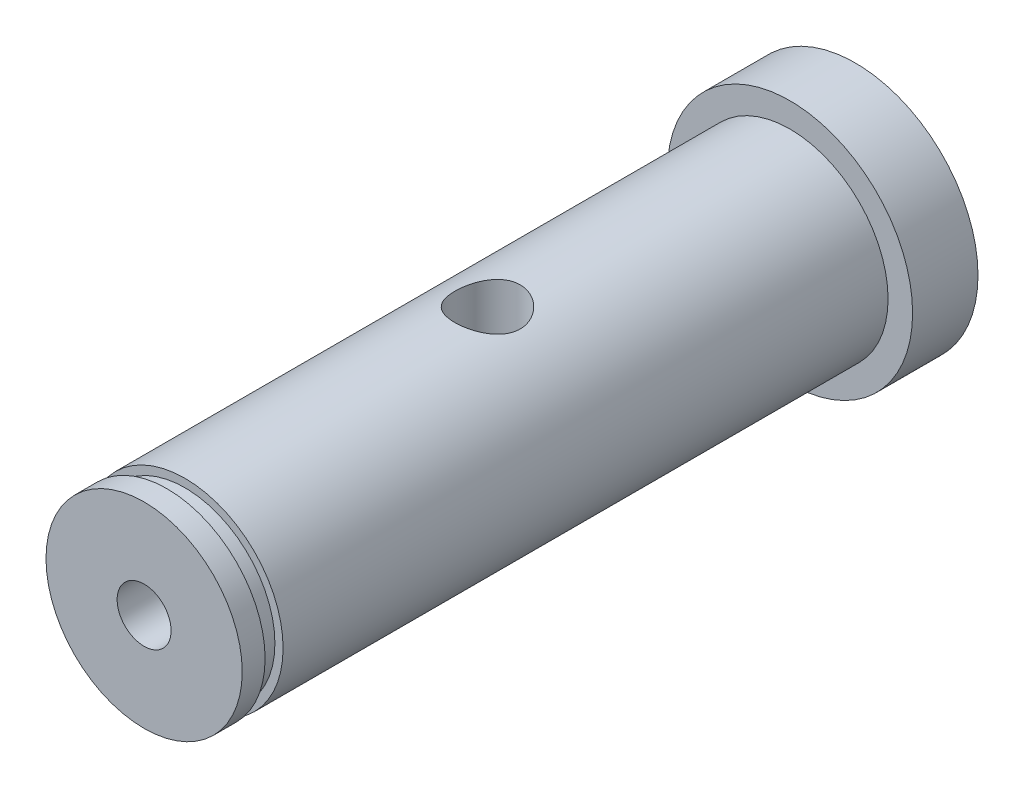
ISO-10303-21;
HEADER;
FILE_DESCRIPTION(('STEP AP214'),'2;1');
FILE_NAME('part.step','',(''),(''),'','','');
FILE_SCHEMA(('AUTOMOTIVE_DESIGN { 1 0 10303 214 1 1 1 1 }'));
ENDSEC;
DATA;
#1=APPLICATION_CONTEXT('core data for automotive mechanical design processes');
#2=APPLICATION_PROTOCOL_DEFINITION('international standard','automotive_design',2000,#1);
#3=PRODUCT_CONTEXT('',#1,'mechanical');
#4=PRODUCT('Part','Part','',(#3));
#5=PRODUCT_RELATED_PRODUCT_CATEGORY('part','',(#4));
#6=PRODUCT_DEFINITION_FORMATION('','',#4);
#7=PRODUCT_DEFINITION_CONTEXT('part definition',#1,'design');
#8=PRODUCT_DEFINITION('design','',#6,#7);
#9=PRODUCT_DEFINITION_SHAPE('','',#8);
#10=(LENGTH_UNIT() NAMED_UNIT(*) SI_UNIT(.MILLI.,.METRE.));
#11=(NAMED_UNIT(*) PLANE_ANGLE_UNIT() SI_UNIT($,.RADIAN.));
#12=(NAMED_UNIT(*) SI_UNIT($,.STERADIAN.) SOLID_ANGLE_UNIT());
#13=UNCERTAINTY_MEASURE_WITH_UNIT(LENGTH_MEASURE(1.E-05),#10,'distance_accuracy_value','');
#14=(GEOMETRIC_REPRESENTATION_CONTEXT(3) GLOBAL_UNCERTAINTY_ASSIGNED_CONTEXT((#13)) GLOBAL_UNIT_ASSIGNED_CONTEXT((#10,
#11,#12)) REPRESENTATION_CONTEXT('',''));
#15=CARTESIAN_POINT('',(0.,0.,0.));
#16=DIRECTION('',(0.,0.,1.));
#17=DIRECTION('',(1.,0.,0.));
#18=AXIS2_PLACEMENT_3D('',#15,#16,#17);
#19=CARTESIAN_POINT('',(0.,0.,21.));
#20=DIRECTION('',(0.,0.,-1.));
#21=DIRECTION('',(-1.,0.,0.));
#22=AXIS2_PLACEMENT_3D('',#19,#20,#21);
#23=CYLINDRICAL_SURFACE('',#22,6.);
#24=CARTESIAN_POINT('',(0.,0.,19.6));
#25=DIRECTION('',(0.,0.,1.));
#26=DIRECTION('',(1.,0.,0.));
#27=AXIS2_PLACEMENT_3D('',#24,#25,#26);
#28=CIRCLE('',#27,6.);
#29=CARTESIAN_POINT('',(-6.,0.,19.6));
#30=VERTEX_POINT('',#29);
#31=EDGE_CURVE('E51',#30,#30,#28,.T.);
#32=CARTESIAN_POINT('',(0.,0.,21.));
#33=DIRECTION('',(0.,0.,1.));
#34=DIRECTION('',(1.,0.,0.));
#35=AXIS2_PLACEMENT_3D('',#32,#33,#34);
#36=CIRCLE('',#35,6.);
#37=CARTESIAN_POINT('',(-6.,0.,21.));
#38=VERTEX_POINT('',#37);
#39=EDGE_CURVE('E11',#38,#38,#36,.T.);
#40=CARTESIAN_POINT('',(-6.,0.,19.6));
#41=CARTESIAN_POINT('',(-6.,0.,19.6145833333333));
#42=CARTESIAN_POINT('',(-6.,0.,19.6291666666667));
#43=CARTESIAN_POINT('',(-6.,0.,19.6583333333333));
#44=CARTESIAN_POINT('',(-6.,0.,19.6729166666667));
#45=CARTESIAN_POINT('',(-6.,0.,19.7020833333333));
#46=CARTESIAN_POINT('',(-6.,0.,19.7166666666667));
#47=CARTESIAN_POINT('',(-6.,0.,19.7458333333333));
#48=CARTESIAN_POINT('',(-6.,0.,19.7604166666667));
#49=CARTESIAN_POINT('',(-6.,0.,19.7895833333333));
#50=CARTESIAN_POINT('',(-6.,0.,19.8041666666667));
#51=CARTESIAN_POINT('',(-6.,0.,19.8333333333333));
#52=CARTESIAN_POINT('',(-6.,0.,19.8479166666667));
#53=CARTESIAN_POINT('',(-6.,0.,19.8770833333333));
#54=CARTESIAN_POINT('',(-6.,0.,19.8916666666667));
#55=CARTESIAN_POINT('',(-6.,0.,19.9208333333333));
#56=CARTESIAN_POINT('',(-6.,0.,19.9354166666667));
#57=CARTESIAN_POINT('',(-6.,0.,19.9645833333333));
#58=CARTESIAN_POINT('',(-6.,0.,19.9791666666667));
#59=CARTESIAN_POINT('',(-6.,0.,20.0083333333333));
#60=CARTESIAN_POINT('',(-6.,0.,20.0229166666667));
#61=CARTESIAN_POINT('',(-6.,0.,20.0520833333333));
#62=CARTESIAN_POINT('',(-6.,0.,20.0666666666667));
#63=CARTESIAN_POINT('',(-6.,0.,20.0958333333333));
#64=CARTESIAN_POINT('',(-6.,0.,20.1104166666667));
#65=CARTESIAN_POINT('',(-6.,0.,20.1395833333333));
#66=CARTESIAN_POINT('',(-6.,0.,20.1541666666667));
#67=CARTESIAN_POINT('',(-6.,0.,20.1833333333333));
#68=CARTESIAN_POINT('',(-6.,0.,20.1979166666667));
#69=CARTESIAN_POINT('',(-6.,0.,20.2270833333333));
#70=CARTESIAN_POINT('',(-6.,0.,20.2416666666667));
#71=CARTESIAN_POINT('',(-6.,0.,20.2708333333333));
#72=CARTESIAN_POINT('',(-6.,0.,20.2854166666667));
#73=CARTESIAN_POINT('',(-6.,0.,20.3145833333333));
#74=CARTESIAN_POINT('',(-6.,0.,20.3291666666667));
#75=CARTESIAN_POINT('',(-6.,0.,20.3583333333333));
#76=CARTESIAN_POINT('',(-6.,0.,20.3729166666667));
#77=CARTESIAN_POINT('',(-6.,0.,20.4020833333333));
#78=CARTESIAN_POINT('',(-6.,0.,20.4166666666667));
#79=CARTESIAN_POINT('',(-6.,0.,20.4458333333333));
#80=CARTESIAN_POINT('',(-6.,0.,20.4604166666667));
#81=CARTESIAN_POINT('',(-6.,0.,20.4895833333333));
#82=CARTESIAN_POINT('',(-6.,0.,20.5041666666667));
#83=CARTESIAN_POINT('',(-6.,0.,20.5333333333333));
#84=CARTESIAN_POINT('',(-6.,0.,20.5479166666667));
#85=CARTESIAN_POINT('',(-6.,0.,20.5770833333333));
#86=CARTESIAN_POINT('',(-6.,0.,20.5916666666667));
#87=CARTESIAN_POINT('',(-6.,0.,20.6208333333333));
#88=CARTESIAN_POINT('',(-6.,0.,20.6354166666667));
#89=CARTESIAN_POINT('',(-6.,0.,20.6645833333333));
#90=CARTESIAN_POINT('',(-6.,0.,20.6791666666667));
#91=CARTESIAN_POINT('',(-6.,0.,20.7083333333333));
#92=CARTESIAN_POINT('',(-6.,0.,20.7229166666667));
#93=CARTESIAN_POINT('',(-6.,0.,20.7520833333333));
#94=CARTESIAN_POINT('',(-6.,0.,20.7666666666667));
#95=CARTESIAN_POINT('',(-6.,0.,20.7958333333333));
#96=CARTESIAN_POINT('',(-6.,0.,20.8104166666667));
#97=CARTESIAN_POINT('',(-6.,0.,20.8395833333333));
#98=CARTESIAN_POINT('',(-6.,0.,20.8541666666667));
#99=CARTESIAN_POINT('',(-6.,0.,20.8833333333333));
#100=CARTESIAN_POINT('',(-6.,0.,20.8979166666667));
#101=CARTESIAN_POINT('',(-6.,0.,20.9270833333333));
#102=CARTESIAN_POINT('',(-6.,0.,20.9416666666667));
#103=CARTESIAN_POINT('',(-6.,0.,20.9708333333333));
#104=CARTESIAN_POINT('',(-6.,0.,20.9854166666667));
#105=CARTESIAN_POINT('',(-6.,0.,21.));
#106=B_SPLINE_CURVE_WITH_KNOTS('',3,(#40,#41,#42,#43,#44,#45,#46,#47,#48,#49,#50,#51,#52,#53,
#54,#55,#56,#57,#58,#59,#60,#61,#62,#63,#64,#65,#66,#67,#68,#69,#70,#71,#72,#73,#74,#75,#76,#77,
#78,#79,#80,#81,#82,#83,#84,#85,#86,#87,#88,#89,#90,#91,#92,#93,#94,#95,#96,#97,#98,#99,#100,
#101,#102,#103,#104,#105),.UNSPECIFIED.,.F.,.F.,(4,2,2,2,2,2,2,2,2,2,2,2,2,2,2,2,2,2,2,2,2,2,2,
2,2,2,2,2,2,2,2,2,4),(0.,0.0437500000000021,0.0875000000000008,0.131250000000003,
0.175000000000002,0.21875,0.262500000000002,0.306250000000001,0.350000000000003,
0.393750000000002,0.437500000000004,0.481250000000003,0.525000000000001,0.568750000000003,
0.612500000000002,0.656250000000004,0.700000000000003,0.743750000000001,0.787500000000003,
0.831250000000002,0.875000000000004,0.918750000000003,0.962500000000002,1.00625,1.05,1.09375,
1.1375,1.18125,1.225,1.26875,1.3125,1.35625,1.40000000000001),.UNSPECIFIED.);
#107=EDGE_CURVE('BSEAM40',#30,#38,#106,.T.);
#108=ORIENTED_EDGE('',*,*,#31,.T.);
#109=ORIENTED_EDGE('',*,*,#39,.F.);
#110=ORIENTED_EDGE('',*,*,#107,.T.);
#111=ORIENTED_EDGE('',*,*,#107,.F.);
#112=EDGE_LOOP('',(#108,#110,#109,#111));
#113=FACE_BOUND('',#112,.T.);
#114=ADVANCED_FACE('F40',(#113),#23,.T.);
#115=CARTESIAN_POINT('',(0.,0.,21.));
#116=DIRECTION('',(0.,0.,1.));
#117=DIRECTION('',(1.,0.,0.));
#118=AXIS2_PLACEMENT_3D('',#115,#116,#117);
#119=PLANE('',#118);
#120=CARTESIAN_POINT('',(0.,0.,21.));
#121=DIRECTION('',(0.,0.,1.));
#122=DIRECTION('',(1.,0.,0.));
#123=AXIS2_PLACEMENT_3D('',#120,#121,#122);
#124=CIRCLE('',#123,1.64999999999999);
#125=CARTESIAN_POINT('',(1.64999999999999,0.,21.));
#126=VERTEX_POINT('',#125);
#127=EDGE_CURVE('E66',#126,#126,#124,.T.);
#128=ORIENTED_EDGE('',*,*,#127,.F.);
#129=EDGE_LOOP('',(#128));
#130=FACE_BOUND('',#129,.T.);
#131=ORIENTED_EDGE('',*,*,#39,.T.);
#132=EDGE_LOOP('',(#131));
#133=FACE_BOUND('',#132,.T.);
#134=ADVANCED_FACE('F117',(#130,#133),#119,.T.);
#135=CARTESIAN_POINT('',(0.,0.,19.6));
#136=DIRECTION('',(0.,0.,1.));
#137=DIRECTION('',(1.,0.,0.));
#138=AXIS2_PLACEMENT_3D('',#135,#136,#137);
#139=PLANE('',#138);
#140=CARTESIAN_POINT('',(0.,0.,19.6));
#141=DIRECTION('',(0.,0.,1.));
#142=DIRECTION('',(1.,0.,0.));
#143=AXIS2_PLACEMENT_3D('',#140,#141,#142);
#144=CIRCLE('',#143,5.5);
#145=CARTESIAN_POINT('',(5.5,0.,19.6));
#146=VERTEX_POINT('',#145);
#147=EDGE_CURVE('E69',#146,#146,#144,.T.);
#148=ORIENTED_EDGE('',*,*,#147,.T.);
#149=EDGE_LOOP('',(#148));
#150=FACE_BOUND('',#149,.T.);
#151=ORIENTED_EDGE('',*,*,#31,.F.);
#152=EDGE_LOOP('',(#151));
#153=FACE_BOUND('',#152,.T.);
#154=ADVANCED_FACE('F114',(#150,#153),#139,.F.);
#155=CARTESIAN_POINT('',(0.,0.,18.5));
#156=DIRECTION('',(0.,0.,1.));
#157=DIRECTION('',(1.,0.,0.));
#158=AXIS2_PLACEMENT_3D('',#155,#156,#157);
#159=PLANE('',#158);
#160=CARTESIAN_POINT('',(0.,0.,18.5));
#161=DIRECTION('',(0.,0.,1.));
#162=DIRECTION('',(1.,0.,0.));
#163=AXIS2_PLACEMENT_3D('',#160,#161,#162);
#164=CIRCLE('',#163,5.5);
#165=CARTESIAN_POINT('',(5.5,0.,18.5));
#166=VERTEX_POINT('',#165);
#167=EDGE_CURVE('E65',#166,#166,#164,.T.);
#168=ORIENTED_EDGE('',*,*,#167,.F.);
#169=EDGE_LOOP('',(#168));
#170=FACE_BOUND('',#169,.T.);
#171=CARTESIAN_POINT('',(0.,0.,18.5));
#172=DIRECTION('',(0.,0.,1.));
#173=DIRECTION('',(1.,0.,0.));
#174=AXIS2_PLACEMENT_3D('',#171,#172,#173);
#175=CIRCLE('',#174,6.);
#176=CARTESIAN_POINT('',(6.,0.,18.5));
#177=VERTEX_POINT('',#176);
#178=EDGE_CURVE('E77',#177,#177,#175,.T.);
#179=ORIENTED_EDGE('',*,*,#178,.T.);
#180=EDGE_LOOP('',(#179));
#181=FACE_BOUND('',#180,.T.);
#182=ADVANCED_FACE('F112',(#170,#181),#159,.T.);
#183=CARTESIAN_POINT('',(0.,0.,19.6));
#184=DIRECTION('',(0.,0.,-1.));
#185=DIRECTION('',(-1.,0.,0.));
#186=AXIS2_PLACEMENT_3D('',#183,#184,#185);
#187=CYLINDRICAL_SURFACE('',#186,5.5);
#188=ORIENTED_EDGE('',*,*,#147,.F.);
#189=EDGE_LOOP('',(#188));
#190=FACE_BOUND('',#189,.T.);
#191=ORIENTED_EDGE('',*,*,#167,.T.);
#192=EDGE_LOOP('',(#191));
#193=FACE_BOUND('',#192,.T.);
#194=ADVANCED_FACE('F109',(#190,#193),#187,.T.);
#195=CARTESIAN_POINT('',(0.,-6.,2.));
#196=CARTESIAN_POINT('',(0.109126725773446,-6.00000030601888,2.00000050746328));
#197=CARTESIAN_POINT('',(0.2182503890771,-5.9969953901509,1.99103946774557));
#198=CARTESIAN_POINT('',(0.433283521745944,-5.98530420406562,1.95554178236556));
#199=CARTESIAN_POINT('',(0.539192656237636,-5.97661734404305,1.92900331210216));
#200=CARTESIAN_POINT('',(0.744665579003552,-5.95450615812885,1.8593615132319));
#201=CARTESIAN_POINT('',(0.844239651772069,-5.94108975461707,1.81628587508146));
#202=CARTESIAN_POINT('',(1.03474987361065,-5.91088891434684,1.71491765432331));
#203=CARTESIAN_POINT('',(1.12568431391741,-5.89410381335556,1.6566220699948));
#204=CARTESIAN_POINT('',(1.29948335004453,-5.8582818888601,1.52434839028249));
#205=CARTESIAN_POINT('',(1.38200740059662,-5.8391911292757,1.44993753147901));
#206=CARTESIAN_POINT('',(1.53366538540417,-5.80120629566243,1.28846569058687));
#207=CARTESIAN_POINT('',(1.60279637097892,-5.78231226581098,1.20140193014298));
#208=CARTESIAN_POINT('',(1.72764988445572,-5.74626664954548,1.01402976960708));
#209=CARTESIAN_POINT('',(1.78292971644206,-5.72918078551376,0.913412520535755));
#210=CARTESIAN_POINT('',(1.87563774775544,-5.69950610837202,0.703647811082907));
#211=CARTESIAN_POINT('',(1.91307139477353,-5.68691592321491,0.594502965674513));
#212=CARTESIAN_POINT('',(1.96774692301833,-5.66822606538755,0.374653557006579));
#213=CARTESIAN_POINT('',(1.98562689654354,-5.66192191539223,0.264125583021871));
#214=CARTESIAN_POINT('',(2.00268224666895,-5.65591313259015,0.0414724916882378));
#215=CARTESIAN_POINT('',(2.00186340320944,-5.6562064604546,-0.0706521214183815));
#216=CARTESIAN_POINT('',(1.98203980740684,-5.6631803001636,-0.287873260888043));
#217=CARTESIAN_POINT('',(1.96386782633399,-5.66956831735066,-0.393056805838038));
#218=CARTESIAN_POINT('',(1.91121232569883,-5.68753315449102,-0.59878683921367));
#219=CARTESIAN_POINT('',(1.87672685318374,-5.69911059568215,-0.699332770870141));
#220=CARTESIAN_POINT('',(1.79187811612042,-5.72635822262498,-0.894825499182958));
#221=CARTESIAN_POINT('',(1.74126809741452,-5.74209131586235,-0.989656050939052));
#222=CARTESIAN_POINT('',(1.62577821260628,-5.77585117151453,-1.16974181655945));
#223=CARTESIAN_POINT('',(1.56089422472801,-5.79387859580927,-1.25499425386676));
#224=CARTESIAN_POINT('',(1.41469866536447,-5.83134658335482,-1.41818319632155));
#225=CARTESIAN_POINT('',(1.33270630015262,-5.85081178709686,-1.49550538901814));
#226=CARTESIAN_POINT('',(1.15667913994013,-5.88813876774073,-1.6354625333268));
#227=CARTESIAN_POINT('',(1.06264319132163,-5.90600039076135,-1.69809607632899));
#228=CARTESIAN_POINT('',(0.863895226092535,-5.93834215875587,-1.80739260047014));
#229=CARTESIAN_POINT('',(0.759086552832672,-5.95278700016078,-1.85389098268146));
#230=CARTESIAN_POINT('',(0.542538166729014,-5.9764113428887,-1.92840634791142));
#231=CARTESIAN_POINT('',(0.430800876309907,-5.98559267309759,-1.95642975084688));
#232=CARTESIAN_POINT('',(0.208767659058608,-5.99735254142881,-1.99211133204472));
#233=CARTESIAN_POINT('',(0.098619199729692,-6.00020003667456,-2.0005996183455));
#234=CARTESIAN_POINT('',(-0.121550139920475,-5.99977805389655,-1.99933465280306));
#235=CARTESIAN_POINT('',(-0.231571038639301,-5.99650960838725,-1.98958448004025));
#236=CARTESIAN_POINT('',(-0.445039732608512,-5.98440049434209,-1.95277618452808));
#237=CARTESIAN_POINT('',(-0.548585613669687,-5.97572397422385,-1.92622758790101));
#238=CARTESIAN_POINT('',(-0.749711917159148,-5.9538369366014,-1.85721311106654));
#239=CARTESIAN_POINT('',(-0.847291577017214,-5.9406258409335,-1.81474520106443));
#240=CARTESIAN_POINT('',(-1.03657659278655,-5.91057862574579,-1.71385913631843));
#241=CARTESIAN_POINT('',(-1.12805991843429,-5.89365629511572,-1.65505081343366));
#242=CARTESIAN_POINT('',(-1.30012966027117,-5.85810507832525,-1.52361169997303));
#243=CARTESIAN_POINT('',(-1.38071273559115,-5.83947567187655,-1.45097668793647));
#244=CARTESIAN_POINT('',(-1.5325050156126,-5.8015369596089,-1.29004249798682));
#245=CARTESIAN_POINT('',(-1.60312193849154,-5.78223522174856,-1.20118154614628));
#246=CARTESIAN_POINT('',(-1.72851504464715,-5.74599946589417,-1.01245686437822));
#247=CARTESIAN_POINT('',(-1.78329109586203,-5.72906546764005,-0.912593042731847));
#248=CARTESIAN_POINT('',(-1.87519386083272,-5.69964783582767,-0.704653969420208));
#249=CARTESIAN_POINT('',(-1.91235626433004,-5.68715521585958,-0.596595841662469));
#250=CARTESIAN_POINT('',(-1.96778933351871,-5.66821664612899,-0.375242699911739));
#251=CARTESIAN_POINT('',(-1.98606850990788,-5.66176797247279,-0.261950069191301));
#252=CARTESIAN_POINT('',(-2.00255256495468,-5.65595717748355,-0.0396058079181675));
#253=CARTESIAN_POINT('',(-2.0017405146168,-5.6562480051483,0.0693646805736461));
#254=CARTESIAN_POINT('',(-1.98248458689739,-5.66302539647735,0.285530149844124));
#255=CARTESIAN_POINT('',(-1.96404175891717,-5.66951159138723,0.392725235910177));
#256=CARTESIAN_POINT('',(-1.91074362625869,-5.68769048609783,0.600271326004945));
#257=CARTESIAN_POINT('',(-1.87620669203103,-5.69928196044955,0.700713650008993));
#258=CARTESIAN_POINT('',(-1.79195873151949,-5.72632797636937,0.894454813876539));
#259=CARTESIAN_POINT('',(-1.74224433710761,-5.74178337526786,0.987752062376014));
#260=CARTESIAN_POINT('',(-1.62652138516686,-5.77565658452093,1.16896733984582));
#261=CARTESIAN_POINT('',(-1.55989648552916,-5.79417423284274,1.25647300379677));
#262=CARTESIAN_POINT('',(-1.4132857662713,-5.83166712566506,1.4193796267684));
#263=CARTESIAN_POINT('',(-1.33329616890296,-5.85064249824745,1.49477715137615));
#264=CARTESIAN_POINT('',(-1.15848311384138,-5.88780061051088,1.63428882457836));
#265=CARTESIAN_POINT('',(-1.06320302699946,-5.90592363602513,1.697848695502));
#266=CARTESIAN_POINT('',(-0.862714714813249,-5.93851982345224,1.80798085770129));
#267=CARTESIAN_POINT('',(-0.757509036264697,-5.9529939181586,1.85455749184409));
#268=CARTESIAN_POINT('',(-0.544987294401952,-5.97611030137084,1.92744326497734));
#269=CARTESIAN_POINT('',(-0.437975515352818,-5.98498424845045,1.95456493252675));
#270=CARTESIAN_POINT('',(-0.220640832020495,-5.99692814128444,1.99084056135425));
#271=CARTESIAN_POINT('',(-0.110318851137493,-5.9999996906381,1.99999948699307));
#272=CARTESIAN_POINT('',(0.,-6.,2.));
#273=B_SPLINE_CURVE_WITH_KNOTS('',3,(#195,#196,#197,#198,#199,#200,#201,#202,#203,#204,#205,
#206,#207,#208,#209,#210,#211,#212,#213,#214,#215,#216,#217,#218,#219,#220,#221,#222,#223,#224,
#225,#226,#227,#228,#229,#230,#231,#232,#233,#234,#235,#236,#237,#238,#239,#240,#241,#242,#243,
#244,#245,#246,#247,#248,#249,#250,#251,#252,#253,#254,#255,#256,#257,#258,#259,#260,#261,#262,
#263,#264,#265,#266,#267,#268,#269,#270,#271,#272),.UNSPECIFIED.,.T.,.F.,(4,2,2,2,2,2,2,2,2,2,2,
2,2,2,2,2,2,2,2,2,2,2,2,2,2,2,2,2,2,2,2,2,2,2,2,2,2,2,4),(0.,0.326974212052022,
0.653982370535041,0.980445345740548,1.3069727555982,1.64369368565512,1.9804886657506,
2.32696769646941,2.67334089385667,3.0080385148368,3.34263267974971,3.66193653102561,
3.98127861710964,4.30576342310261,4.63034205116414,4.97186611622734,5.31342291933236,
5.65836811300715,6.00319337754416,6.33307166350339,6.66289426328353,6.98316315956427,
7.30347290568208,7.63220799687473,7.96104361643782,8.30482045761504,8.64860016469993,
8.99168027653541,9.3346056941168,9.65991332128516,9.9852015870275,10.3043117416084,
10.6234927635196,10.9566013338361,11.2898042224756,11.635993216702,11.9820936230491,
12.3127311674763,12.6432773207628),.UNSPECIFIED.);
#274=CARTESIAN_POINT('',(0.,-6.,2.));
#275=VERTEX_POINT('',#274);
#276=EDGE_CURVE('E44',#275,#275,#273,.T.);
#277=ORIENTED_EDGE('',*,*,#276,.T.);
#278=EDGE_LOOP('',(#277));
#279=FACE_BOUND('',#278,.T.);
#280=CARTESIAN_POINT('',(0.,6.,2.));
#281=CARTESIAN_POINT('',(-0.109126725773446,6.00000030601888,2.00000050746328));
#282=CARTESIAN_POINT('',(-0.2182503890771,5.9969953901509,1.99103946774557));
#283=CARTESIAN_POINT('',(-0.433283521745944,5.98530420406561,1.95554178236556));
#284=CARTESIAN_POINT('',(-0.539192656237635,5.97661734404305,1.92900331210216));
#285=CARTESIAN_POINT('',(-0.744665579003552,5.95450615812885,1.8593615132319));
#286=CARTESIAN_POINT('',(-0.844239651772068,5.94108975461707,1.81628587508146));
#287=CARTESIAN_POINT('',(-1.03474987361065,5.91088891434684,1.71491765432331));
#288=CARTESIAN_POINT('',(-1.12568431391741,5.89410381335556,1.6566220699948));
#289=CARTESIAN_POINT('',(-1.29948335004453,5.8582818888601,1.52434839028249));
#290=CARTESIAN_POINT('',(-1.38200740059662,5.8391911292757,1.44993753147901));
#291=CARTESIAN_POINT('',(-1.53366538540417,5.80120629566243,1.28846569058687));
#292=CARTESIAN_POINT('',(-1.60279637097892,5.78231226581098,1.20140193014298));
#293=CARTESIAN_POINT('',(-1.72764988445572,5.74626664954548,1.01402976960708));
#294=CARTESIAN_POINT('',(-1.78292971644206,5.72918078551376,0.913412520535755));
#295=CARTESIAN_POINT('',(-1.87563774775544,5.69950610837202,0.703647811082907));
#296=CARTESIAN_POINT('',(-1.91307139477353,5.68691592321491,0.594502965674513));
#297=CARTESIAN_POINT('',(-1.96774692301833,5.66822606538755,0.374653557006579));
#298=CARTESIAN_POINT('',(-1.98562689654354,5.66192191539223,0.264125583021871));
#299=CARTESIAN_POINT('',(-2.00268224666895,5.65591313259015,0.0414724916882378));
#300=CARTESIAN_POINT('',(-2.00186340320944,5.6562064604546,-0.0706521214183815));
#301=CARTESIAN_POINT('',(-1.98203980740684,5.6631803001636,-0.287873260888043));
#302=CARTESIAN_POINT('',(-1.96386782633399,5.66956831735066,-0.393056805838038));
#303=CARTESIAN_POINT('',(-1.91121232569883,5.68753315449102,-0.59878683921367));
#304=CARTESIAN_POINT('',(-1.87672685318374,5.69911059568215,-0.699332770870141));
#305=CARTESIAN_POINT('',(-1.79187811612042,5.72635822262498,-0.894825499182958));
#306=CARTESIAN_POINT('',(-1.74126809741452,5.74209131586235,-0.989656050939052));
#307=CARTESIAN_POINT('',(-1.62577821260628,5.77585117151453,-1.16974181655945));
#308=CARTESIAN_POINT('',(-1.56089422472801,5.79387859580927,-1.25499425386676));
#309=CARTESIAN_POINT('',(-1.41469866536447,5.83134658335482,-1.41818319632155));
#310=CARTESIAN_POINT('',(-1.33270630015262,5.85081178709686,-1.49550538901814));
#311=CARTESIAN_POINT('',(-1.15667913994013,5.88813876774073,-1.6354625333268));
#312=CARTESIAN_POINT('',(-1.06264319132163,5.90600039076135,-1.69809607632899));
#313=CARTESIAN_POINT('',(-0.863895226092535,5.93834215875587,-1.80739260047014));
#314=CARTESIAN_POINT('',(-0.759086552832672,5.95278700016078,-1.85389098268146));
#315=CARTESIAN_POINT('',(-0.542538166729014,5.9764113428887,-1.92840634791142));
#316=CARTESIAN_POINT('',(-0.430800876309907,5.98559267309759,-1.95642975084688));
#317=CARTESIAN_POINT('',(-0.208767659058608,5.99735254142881,-1.99211133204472));
#318=CARTESIAN_POINT('',(-0.098619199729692,6.00020003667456,-2.0005996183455));
#319=CARTESIAN_POINT('',(0.121550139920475,5.99977805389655,-1.99933465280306));
#320=CARTESIAN_POINT('',(0.231571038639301,5.99650960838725,-1.98958448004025));
#321=CARTESIAN_POINT('',(0.445039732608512,5.98440049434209,-1.95277618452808));
#322=CARTESIAN_POINT('',(0.548585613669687,5.97572397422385,-1.92622758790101));
#323=CARTESIAN_POINT('',(0.749711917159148,5.9538369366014,-1.85721311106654));
#324=CARTESIAN_POINT('',(0.847291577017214,5.9406258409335,-1.81474520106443));
#325=CARTESIAN_POINT('',(1.03657659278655,5.91057862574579,-1.71385913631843));
#326=CARTESIAN_POINT('',(1.12805991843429,5.89365629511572,-1.65505081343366));
#327=CARTESIAN_POINT('',(1.30012966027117,5.85810507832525,-1.52361169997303));
#328=CARTESIAN_POINT('',(1.38071273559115,5.83947567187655,-1.45097668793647));
#329=CARTESIAN_POINT('',(1.5325050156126,5.8015369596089,-1.29004249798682));
#330=CARTESIAN_POINT('',(1.60312193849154,5.78223522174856,-1.20118154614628));
#331=CARTESIAN_POINT('',(1.72851504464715,5.74599946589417,-1.01245686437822));
#332=CARTESIAN_POINT('',(1.78329109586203,5.72906546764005,-0.912593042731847));
#333=CARTESIAN_POINT('',(1.87519386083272,5.69964783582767,-0.704653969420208));
#334=CARTESIAN_POINT('',(1.91235626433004,5.68715521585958,-0.596595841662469));
#335=CARTESIAN_POINT('',(1.96778933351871,5.66821664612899,-0.375242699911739));
#336=CARTESIAN_POINT('',(1.98606850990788,5.66176797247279,-0.261950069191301));
#337=CARTESIAN_POINT('',(2.00255256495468,5.65595717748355,-0.0396058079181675));
#338=CARTESIAN_POINT('',(2.0017405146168,5.6562480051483,0.0693646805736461));
#339=CARTESIAN_POINT('',(1.98248458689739,5.66302539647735,0.285530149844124));
#340=CARTESIAN_POINT('',(1.96404175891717,5.66951159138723,0.392725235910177));
#341=CARTESIAN_POINT('',(1.91074362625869,5.68769048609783,0.600271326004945));
#342=CARTESIAN_POINT('',(1.87620669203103,5.69928196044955,0.700713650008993));
#343=CARTESIAN_POINT('',(1.79195873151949,5.72632797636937,0.894454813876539));
#344=CARTESIAN_POINT('',(1.74224433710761,5.74178337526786,0.987752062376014));
#345=CARTESIAN_POINT('',(1.62652138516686,5.77565658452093,1.16896733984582));
#346=CARTESIAN_POINT('',(1.55989648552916,5.79417423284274,1.25647300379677));
#347=CARTESIAN_POINT('',(1.4132857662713,5.83166712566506,1.4193796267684));
#348=CARTESIAN_POINT('',(1.33329616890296,5.85064249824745,1.49477715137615));
#349=CARTESIAN_POINT('',(1.15848311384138,5.88780061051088,1.63428882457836));
#350=CARTESIAN_POINT('',(1.06320302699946,5.90592363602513,1.697848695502));
#351=CARTESIAN_POINT('',(0.862714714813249,5.93851982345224,1.80798085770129));
#352=CARTESIAN_POINT('',(0.757509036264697,5.9529939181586,1.85455749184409));
#353=CARTESIAN_POINT('',(0.544987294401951,5.97611030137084,1.92744326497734));
#354=CARTESIAN_POINT('',(0.437975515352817,5.98498424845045,1.95456493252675));
#355=CARTESIAN_POINT('',(0.220640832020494,5.99692814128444,1.99084056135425));
#356=CARTESIAN_POINT('',(0.110318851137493,5.9999996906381,1.99999948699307));
#357=CARTESIAN_POINT('',(0.,6.,2.));
#358=B_SPLINE_CURVE_WITH_KNOTS('',3,(#280,#281,#282,#283,#284,#285,#286,#287,#288,#289,#290,
#291,#292,#293,#294,#295,#296,#297,#298,#299,#300,#301,#302,#303,#304,#305,#306,#307,#308,#309,
#310,#311,#312,#313,#314,#315,#316,#317,#318,#319,#320,#321,#322,#323,#324,#325,#326,#327,#328,
#329,#330,#331,#332,#333,#334,#335,#336,#337,#338,#339,#340,#341,#342,#343,#344,#345,#346,#347,
#348,#349,#350,#351,#352,#353,#354,#355,#356,#357),.UNSPECIFIED.,.T.,.F.,(4,2,2,2,2,2,2,2,2,2,2,
2,2,2,2,2,2,2,2,2,2,2,2,2,2,2,2,2,2,2,2,2,2,2,2,2,2,2,4),(0.,0.326974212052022,
0.653982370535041,0.980445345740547,1.3069727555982,1.64369368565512,1.9804886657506,
2.32696769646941,2.67334089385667,3.0080385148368,3.34263267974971,3.66193653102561,
3.98127861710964,4.30576342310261,4.63034205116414,4.97186611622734,5.31342291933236,
5.65836811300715,6.00319337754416,6.33307166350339,6.66289426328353,6.98316315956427,
7.30347290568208,7.63220799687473,7.96104361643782,8.30482045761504,8.64860016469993,
8.99168027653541,9.3346056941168,9.65991332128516,9.9852015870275,10.3043117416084,
10.6234927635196,10.9566013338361,11.2898042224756,11.635993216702,11.9820936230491,
12.3127311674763,12.6432773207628),.UNSPECIFIED.);
#359=CARTESIAN_POINT('',(0.,6.,2.));
#360=VERTEX_POINT('',#359);
#361=EDGE_CURVE('E85',#360,#360,#358,.T.);
#362=ORIENTED_EDGE('',*,*,#361,.T.);
#363=EDGE_LOOP('',(#362));
#364=FACE_BOUND('',#363,.T.);
#365=CARTESIAN_POINT('',(0.,0.,-18.5));
#366=DIRECTION('',(0.,0.,1.));
#367=DIRECTION('',(1.,0.,0.));
#368=AXIS2_PLACEMENT_3D('',#365,#366,#367);
#369=CIRCLE('',#368,6.);
#370=CARTESIAN_POINT('',(6.,0.,-18.5));
#371=VERTEX_POINT('',#370);
#372=EDGE_CURVE('E72',#371,#371,#369,.T.);
#373=ORIENTED_EDGE('',*,*,#372,.T.);
#374=EDGE_LOOP('',(#373));
#375=FACE_BOUND('',#374,.T.);
#376=ORIENTED_EDGE('',*,*,#178,.F.);
#377=EDGE_LOOP('',(#376));
#378=FACE_BOUND('',#377,.T.);
#379=ADVANCED_FACE('F59',(#279,#364,#375,#378),#23,.T.);
#380=CARTESIAN_POINT('',(0.,0.,11.9));
#381=DIRECTION('',(0.,0.,1.));
#382=DIRECTION('',(1.,0.,0.));
#383=AXIS2_PLACEMENT_3D('',#380,#381,#382);
#384=CONICAL_SURFACE('',#383,1.64999999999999,1.02974425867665);
#385=CARTESIAN_POINT('',(0.,0.,10.9085799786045));
#386=VERTEX_POINT('',#385);
#387=VERTEX_LOOP('',#386);
#388=FACE_BOUND('',#387,.T.);
#389=CARTESIAN_POINT('',(0.,0.,11.9));
#390=DIRECTION('',(0.,0.,1.));
#391=DIRECTION('',(1.,0.,0.));
#392=AXIS2_PLACEMENT_3D('',#389,#390,#391);
#393=CIRCLE('',#392,1.64999999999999);
#394=CARTESIAN_POINT('',(1.64999999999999,0.,11.9));
#395=VERTEX_POINT('',#394);
#396=EDGE_CURVE('E63',#395,#395,#393,.T.);
#397=ORIENTED_EDGE('',*,*,#396,.T.);
#398=EDGE_LOOP('',(#397));
#399=FACE_BOUND('',#398,.T.);
#400=ADVANCED_FACE('F55',(#388,#399),#384,.F.);
#401=CARTESIAN_POINT('',(0.,0.,21.));
#402=DIRECTION('',(0.,0.,1.));
#403=DIRECTION('',(1.,0.,0.));
#404=AXIS2_PLACEMENT_3D('',#401,#402,#403);
#405=CYLINDRICAL_SURFACE('',#404,1.64999999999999);
#406=ORIENTED_EDGE('',*,*,#396,.F.);
#407=EDGE_LOOP('',(#406));
#408=FACE_BOUND('',#407,.T.);
#409=ORIENTED_EDGE('',*,*,#127,.T.);
#410=EDGE_LOOP('',(#409));
#411=FACE_BOUND('',#410,.T.);
#412=ADVANCED_FACE('F58',(#408,#411),#405,.F.);
#413=CARTESIAN_POINT('',(0.,0.,-22.5));
#414=DIRECTION('',(0.,0.,1.));
#415=DIRECTION('',(1.,0.,0.));
#416=AXIS2_PLACEMENT_3D('',#413,#414,#415);
#417=CYLINDRICAL_SURFACE('',#416,7.5);
#418=CARTESIAN_POINT('',(0.,0.,-22.5));
#419=DIRECTION('',(0.,0.,1.));
#420=DIRECTION('',(1.,0.,0.));
#421=AXIS2_PLACEMENT_3D('',#418,#419,#420);
#422=CIRCLE('',#421,7.5);
#423=CARTESIAN_POINT('',(7.5,0.,-22.5));
#424=VERTEX_POINT('',#423);
#425=EDGE_CURVE('E84',#424,#424,#422,.T.);
#426=ORIENTED_EDGE('',*,*,#425,.T.);
#427=EDGE_LOOP('',(#426));
#428=FACE_BOUND('',#427,.T.);
#429=CARTESIAN_POINT('',(0.,0.,-18.5));
#430=DIRECTION('',(0.,0.,1.));
#431=DIRECTION('',(1.,0.,0.));
#432=AXIS2_PLACEMENT_3D('',#429,#430,#431);
#433=CIRCLE('',#432,7.5);
#434=CARTESIAN_POINT('',(7.5,0.,-18.5));
#435=VERTEX_POINT('',#434);
#436=EDGE_CURVE('E150',#435,#435,#433,.T.);
#437=ORIENTED_EDGE('',*,*,#436,.F.);
#438=EDGE_LOOP('',(#437));
#439=FACE_BOUND('',#438,.T.);
#440=ADVANCED_FACE('F99',(#428,#439),#417,.T.);
#441=CARTESIAN_POINT('',(0.,0.,-22.5));
#442=DIRECTION('',(0.,0.,1.));
#443=DIRECTION('',(1.,0.,0.));
#444=AXIS2_PLACEMENT_3D('',#441,#442,#443);
#445=PLANE('',#444);
#446=ORIENTED_EDGE('',*,*,#425,.F.);
#447=EDGE_LOOP('',(#446));
#448=FACE_BOUND('',#447,.T.);
#449=ADVANCED_FACE('F95',(#448),#445,.F.);
#450=CARTESIAN_POINT('',(0.,0.,-18.5));
#451=DIRECTION('',(0.,0.,1.));
#452=DIRECTION('',(1.,0.,0.));
#453=AXIS2_PLACEMENT_3D('',#450,#451,#452);
#454=PLANE('',#453);
#455=ORIENTED_EDGE('',*,*,#372,.F.);
#456=EDGE_LOOP('',(#455));
#457=FACE_BOUND('',#456,.T.);
#458=ORIENTED_EDGE('',*,*,#436,.T.);
#459=EDGE_LOOP('',(#458));
#460=FACE_BOUND('',#459,.T.);
#461=ADVANCED_FACE('F93',(#457,#460),#454,.T.);
#462=CARTESIAN_POINT('',(0.,-11.5,0.));
#463=DIRECTION('',(0.,1.,0.));
#464=DIRECTION('',(0.,0.,1.));
#465=AXIS2_PLACEMENT_3D('',#462,#463,#464);
#466=CYLINDRICAL_SURFACE('',#465,2.);
#467=ORIENTED_EDGE('',*,*,#361,.F.);
#468=EDGE_LOOP('',(#467));
#469=FACE_BOUND('',#468,.T.);
#470=ORIENTED_EDGE('',*,*,#276,.F.);
#471=EDGE_LOOP('',(#470));
#472=FACE_BOUND('',#471,.T.);
#473=ADVANCED_FACE('F89',(#469,#472),#466,.F.);
#474=CLOSED_SHELL('',(#114,#134,#154,#182,#194,#379,#400,#412,#440,#449,#461,#473));
#475=MANIFOLD_SOLID_BREP('B2',#474);
#476=ADVANCED_BREP_SHAPE_REPRESENTATION('',(#18,#475),#14);
#477=SHAPE_DEFINITION_REPRESENTATION(#9,#476);
ENDSEC;
END-ISO-10303-21;
